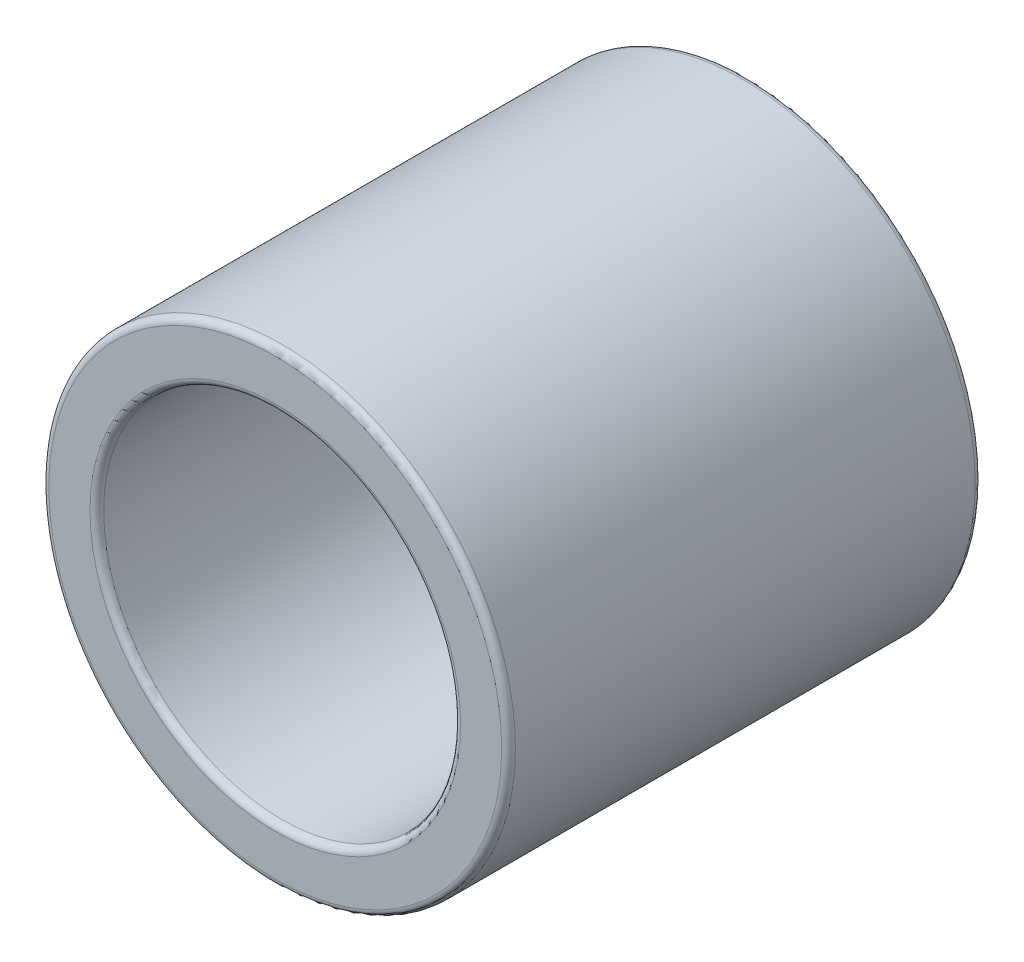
ISO-10303-21;
HEADER;
FILE_DESCRIPTION(('STEP AP214'),'2;1');
FILE_NAME('part.step','',(''),(''),'','','');
FILE_SCHEMA(('AUTOMOTIVE_DESIGN { 1 0 10303 214 1 1 1 1 }'));
ENDSEC;
DATA;
#1=APPLICATION_CONTEXT('core data for automotive mechanical design processes');
#2=APPLICATION_PROTOCOL_DEFINITION('international standard','automotive_design',2000,#1);
#3=PRODUCT_CONTEXT('',#1,'mechanical');
#4=PRODUCT('Part','Part','',(#3));
#5=PRODUCT_RELATED_PRODUCT_CATEGORY('part','',(#4));
#6=PRODUCT_DEFINITION_FORMATION('','',#4);
#7=PRODUCT_DEFINITION_CONTEXT('part definition',#1,'design');
#8=PRODUCT_DEFINITION('design','',#6,#7);
#9=PRODUCT_DEFINITION_SHAPE('','',#8);
#10=(LENGTH_UNIT() NAMED_UNIT(*) SI_UNIT(.MILLI.,.METRE.));
#11=(NAMED_UNIT(*) PLANE_ANGLE_UNIT() SI_UNIT($,.RADIAN.));
#12=(NAMED_UNIT(*) SI_UNIT($,.STERADIAN.) SOLID_ANGLE_UNIT());
#13=UNCERTAINTY_MEASURE_WITH_UNIT(LENGTH_MEASURE(1.E-05),#10,'distance_accuracy_value','');
#14=(GEOMETRIC_REPRESENTATION_CONTEXT(3) GLOBAL_UNCERTAINTY_ASSIGNED_CONTEXT((#13)) GLOBAL_UNIT_ASSIGNED_CONTEXT((#10,
#11,#12)) REPRESENTATION_CONTEXT('',''));
#15=CARTESIAN_POINT('',(0.,0.,0.));
#16=DIRECTION('',(0.,0.,1.));
#17=DIRECTION('',(1.,0.,0.));
#18=AXIS2_PLACEMENT_3D('',#15,#16,#17);
#19=CARTESIAN_POINT('',(0.,0.,34.5));
#20=DIRECTION('',(0.,0.,1.));
#21=DIRECTION('',(1.,0.,0.));
#22=AXIS2_PLACEMENT_3D('',#19,#20,#21);
#23=PLANE('',#22);
#24=CARTESIAN_POINT('',(0.,0.,34.5));
#25=DIRECTION('',(0.,0.,1.));
#26=DIRECTION('',(1.,0.,0.));
#27=AXIS2_PLACEMENT_3D('',#24,#25,#26);
#28=CIRCLE('',#27,13.5);
#29=CARTESIAN_POINT('',(13.5,0.,34.5));
#30=VERTEX_POINT('',#29);
#31=EDGE_CURVE('E10',#30,#30,#28,.F.);
#32=ORIENTED_EDGE('',*,*,#31,.T.);
#33=EDGE_LOOP('',(#32));
#34=FACE_BOUND('',#33,.T.);
#35=CARTESIAN_POINT('',(0.,0.,34.5));
#36=DIRECTION('',(0.,0.,1.));
#37=DIRECTION('',(1.,0.,0.));
#38=AXIS2_PLACEMENT_3D('',#35,#36,#37);
#39=CIRCLE('',#38,16.5);
#40=CARTESIAN_POINT('',(16.5,0.,34.5));
#41=VERTEX_POINT('',#40);
#42=EDGE_CURVE('E35',#41,#41,#39,.T.);
#43=ORIENTED_EDGE('',*,*,#42,.T.);
#44=EDGE_LOOP('',(#43));
#45=FACE_BOUND('',#44,.T.);
#46=ADVANCED_FACE('F28',(#34,#45),#23,.T.);
#47=CARTESIAN_POINT('',(0.,0.,0.));
#48=DIRECTION('',(0.,0.,1.));
#49=DIRECTION('',(1.,0.,0.));
#50=AXIS2_PLACEMENT_3D('',#47,#48,#49);
#51=PLANE('',#50);
#52=CARTESIAN_POINT('',(0.,0.,0.));
#53=DIRECTION('',(0.,0.,1.));
#54=DIRECTION('',(1.,0.,0.));
#55=AXIS2_PLACEMENT_3D('',#52,#53,#54);
#56=CIRCLE('',#55,13.5);
#57=CARTESIAN_POINT('',(13.5,0.,0.));
#58=VERTEX_POINT('',#57);
#59=EDGE_CURVE('E54',#58,#58,#56,.T.);
#60=ORIENTED_EDGE('',*,*,#59,.T.);
#61=EDGE_LOOP('',(#60));
#62=FACE_BOUND('',#61,.T.);
#63=CARTESIAN_POINT('',(0.,0.,0.));
#64=DIRECTION('',(0.,0.,1.));
#65=DIRECTION('',(1.,0.,0.));
#66=AXIS2_PLACEMENT_3D('',#63,#64,#65);
#67=CIRCLE('',#66,16.5);
#68=CARTESIAN_POINT('',(16.5,0.,0.));
#69=VERTEX_POINT('',#68);
#70=EDGE_CURVE('E57',#69,#69,#67,.F.);
#71=ORIENTED_EDGE('',*,*,#70,.T.);
#72=EDGE_LOOP('',(#71));
#73=FACE_BOUND('',#72,.T.);
#74=ADVANCED_FACE('F61',(#62,#73),#51,.F.);
#75=CARTESIAN_POINT('',(0.,0.,34.5));
#76=DIRECTION('',(0.,0.,-1.));
#77=DIRECTION('',(-1.,0.,0.));
#78=AXIS2_PLACEMENT_3D('',#75,#76,#77);
#79=CYLINDRICAL_SURFACE('',#78,17.);
#80=CARTESIAN_POINT('',(0.,0.,0.5));
#81=DIRECTION('',(0.,0.,1.));
#82=DIRECTION('',(1.,0.,0.));
#83=AXIS2_PLACEMENT_3D('',#80,#81,#82);
#84=CIRCLE('',#83,17.);
#85=CARTESIAN_POINT('',(17.,0.,0.5));
#86=VERTEX_POINT('',#85);
#87=EDGE_CURVE('E39',#86,#86,#84,.T.);
#88=ORIENTED_EDGE('',*,*,#87,.T.);
#89=EDGE_LOOP('',(#88));
#90=FACE_BOUND('',#89,.T.);
#91=CARTESIAN_POINT('',(0.,0.,34.));
#92=DIRECTION('',(0.,0.,1.));
#93=DIRECTION('',(1.,0.,0.));
#94=AXIS2_PLACEMENT_3D('',#91,#92,#93);
#95=CIRCLE('',#94,17.);
#96=CARTESIAN_POINT('',(17.,0.,34.));
#97=VERTEX_POINT('',#96);
#98=EDGE_CURVE('E43',#97,#97,#95,.F.);
#99=ORIENTED_EDGE('',*,*,#98,.T.);
#100=EDGE_LOOP('',(#99));
#101=FACE_BOUND('',#100,.T.);
#102=ADVANCED_FACE('F30',(#90,#101),#79,.T.);
#103=CARTESIAN_POINT('',(0.,0.,34.5));
#104=DIRECTION('',(0.,0.,-1.));
#105=DIRECTION('',(-1.,0.,0.));
#106=AXIS2_PLACEMENT_3D('',#103,#104,#105);
#107=CYLINDRICAL_SURFACE('',#106,13.);
#108=CARTESIAN_POINT('',(0.,0.,0.5));
#109=DIRECTION('',(0.,0.,1.));
#110=DIRECTION('',(1.,0.,0.));
#111=AXIS2_PLACEMENT_3D('',#108,#109,#110);
#112=CIRCLE('',#111,13.);
#113=CARTESIAN_POINT('',(13.,0.,0.5));
#114=VERTEX_POINT('',#113);
#115=EDGE_CURVE('E48',#114,#114,#112,.F.);
#116=ORIENTED_EDGE('',*,*,#115,.T.);
#117=EDGE_LOOP('',(#116));
#118=FACE_BOUND('',#117,.T.);
#119=CARTESIAN_POINT('',(0.,0.,34.));
#120=DIRECTION('',(0.,0.,1.));
#121=DIRECTION('',(1.,0.,0.));
#122=AXIS2_PLACEMENT_3D('',#119,#120,#121);
#123=CIRCLE('',#122,13.);
#124=CARTESIAN_POINT('',(13.,0.,34.));
#125=VERTEX_POINT('',#124);
#126=EDGE_CURVE('E51',#125,#125,#123,.T.);
#127=ORIENTED_EDGE('',*,*,#126,.T.);
#128=EDGE_LOOP('',(#127));
#129=FACE_BOUND('',#128,.T.);
#130=ADVANCED_FACE('F73',(#118,#129),#107,.F.);
#131=CARTESIAN_POINT('',(0.,0.,0.5));
#132=DIRECTION('',(0.,0.,1.));
#133=DIRECTION('',(1.,0.,0.));
#134=AXIS2_PLACEMENT_3D('',#131,#132,#133);
#135=TOROIDAL_SURFACE('',#134,13.5,0.5);
#136=ORIENTED_EDGE('',*,*,#115,.F.);
#137=EDGE_LOOP('',(#136));
#138=FACE_BOUND('',#137,.T.);
#139=ORIENTED_EDGE('',*,*,#59,.F.);
#140=EDGE_LOOP('',(#139));
#141=FACE_BOUND('',#140,.T.);
#142=ADVANCED_FACE('F67',(#138,#141),#135,.T.);
#143=CARTESIAN_POINT('',(0.,0.,0.5));
#144=DIRECTION('',(0.,0.,1.));
#145=DIRECTION('',(1.,0.,0.));
#146=AXIS2_PLACEMENT_3D('',#143,#144,#145);
#147=TOROIDAL_SURFACE('',#146,16.5,0.5);
#148=ORIENTED_EDGE('',*,*,#70,.F.);
#149=EDGE_LOOP('',(#148));
#150=FACE_BOUND('',#149,.T.);
#151=ORIENTED_EDGE('',*,*,#87,.F.);
#152=EDGE_LOOP('',(#151));
#153=FACE_BOUND('',#152,.T.);
#154=ADVANCED_FACE('F63',(#150,#153),#147,.T.);
#155=CARTESIAN_POINT('',(0.,0.,34.));
#156=DIRECTION('',(0.,0.,1.));
#157=DIRECTION('',(1.,0.,0.));
#158=AXIS2_PLACEMENT_3D('',#155,#156,#157);
#159=TOROIDAL_SURFACE('',#158,13.5,0.5);
#160=ORIENTED_EDGE('',*,*,#31,.F.);
#161=EDGE_LOOP('',(#160));
#162=FACE_BOUND('',#161,.T.);
#163=ORIENTED_EDGE('',*,*,#126,.F.);
#164=EDGE_LOOP('',(#163));
#165=FACE_BOUND('',#164,.T.);
#166=ADVANCED_FACE('F66',(#162,#165),#159,.T.);
#167=CARTESIAN_POINT('',(0.,0.,34.));
#168=DIRECTION('',(0.,0.,1.));
#169=DIRECTION('',(1.,0.,0.));
#170=AXIS2_PLACEMENT_3D('',#167,#168,#169);
#171=TOROIDAL_SURFACE('',#170,16.5,0.5);
#172=ORIENTED_EDGE('',*,*,#98,.F.);
#173=EDGE_LOOP('',(#172));
#174=FACE_BOUND('',#173,.T.);
#175=ORIENTED_EDGE('',*,*,#42,.F.);
#176=EDGE_LOOP('',(#175));
#177=FACE_BOUND('',#176,.T.);
#178=ADVANCED_FACE('F76',(#174,#177),#171,.T.);
#179=CLOSED_SHELL('',(#46,#74,#102,#130,#142,#154,#166,#178));
#180=MANIFOLD_SOLID_BREP('B2',#179);
#181=ADVANCED_BREP_SHAPE_REPRESENTATION('',(#18,#180),#14);
#182=SHAPE_DEFINITION_REPRESENTATION(#9,#181);
ENDSEC;
END-ISO-10303-21;
